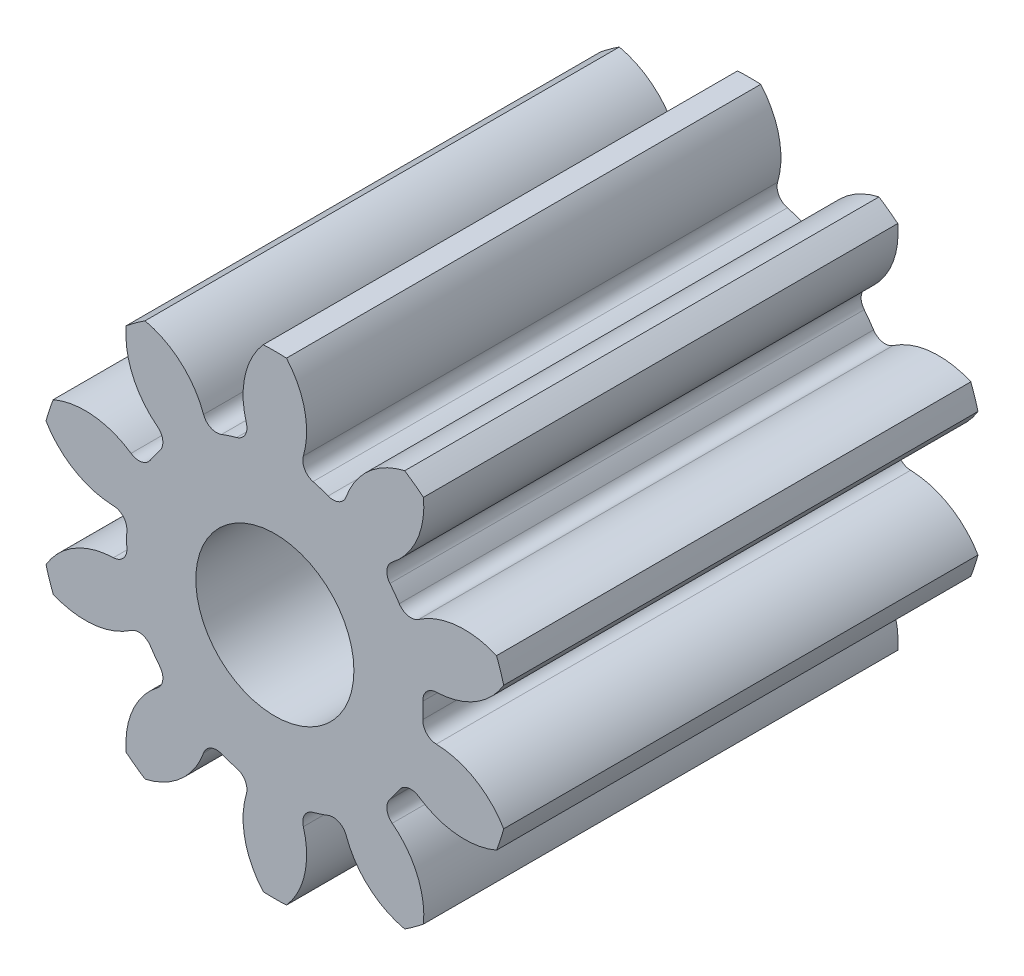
from build123d import *

# Parameters (mm, degrees)
BOSS_EXTRU_1_DEPTH                 = 6
CONG_1_R                           = 0.175
R_P_TITION_CIRCULAIRE4_COUNT       = 10
CONG_1_OF_R_P_TITION_CIRCULAIRE4_R = 0.175
ESQUISSE10_R                       = 1
ENL_V_MAT_EXTRU_4_DEPTH            = 9.181798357


with BuildPart() as part:
    # Esquisse3 → Boss.-Extru.1 (new body)
    with BuildSketch(Plane.XY):
        with BuildLine():
            Line((-1.958113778, 1.222878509), (-1.378706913, -0.560352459))
            Line((-1.378706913, -0.560352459), (-0.799300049, 1.222878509))
            ThreePointArc((-0.799300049, 1.222878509), (-0.942925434, 1.263303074), (-1.089310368, 1.292179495))
            ThreePointArc((-1.089310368, 1.292179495), (-0.984517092, 1.886051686), (-1.231837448, 2.436050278))
            ThreePointArc((-1.231837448, 2.436050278), (-1.378706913, 2.439647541), (-1.525576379, 2.436050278))
            ThreePointArc((-1.525576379, 2.436050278), (-1.772896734, 1.886051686), (-1.668103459, 1.292179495))
            ThreePointArc((-1.668103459, 1.292179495), (-1.814488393, 1.263303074), (-1.958113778, 1.222878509))
        make_face()
    boss_extru_1 = extrude(amount=BOSS_EXTRU_1_DEPTH)

    # Cong_1
    cong_1_edges = [part.edges().sort_by_distance(p)[0] for p in [
        (-1.668103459, 1.292179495, 3),
        (-1.089310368, 1.292179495, 3),
    ]]
    fillet(cong_1_edges, radius=CONG_1_R)

    # R_p_tition circulaire4: Boss.-Extru.1 ×10 about axis
    r_p_tition_circulaire4_axis = Axis((-1.378706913, -0.560352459, 0), (0, 0, 1))
    for i in range(1, R_P_TITION_CIRCULAIRE4_COUNT):
        add(boss_extru_1.rotate(r_p_tition_circulaire4_axis, i * 360 / R_P_TITION_CIRCULAIRE4_COUNT))

    # Cong_1 of R_p_tition circulaire4
    cong_1_of_r_p_tition_circulaire4_edges = [part.edges().sort_by_distance(p)[0] for p in [
        (-2.701724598, 0.768274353, 3),
        (-2.233471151, 1.108480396, 3),
        (-3.22999795, -0.263121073, 3),
        (-3.051141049, 0.287343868, 3),
        (-3.051141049, -1.408048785, 3),
        (-3.22999795, -0.857583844, 3),
        (-2.233471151, -2.229185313, 3),
        (-2.701724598, -1.88897927, 3),
        (-1.089310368, -2.412884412, 3),
        (-1.668103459, -2.412884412, 3),
        (-0.055689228, -1.88897927, 3),
        (-0.523942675, -2.229185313, 3),
        (0.472584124, -0.857583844, 3),
        (0.293727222, -1.408048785, 3),
        (0.293727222, 0.287343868, 3),
        (0.472584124, -0.263121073, 3),
        (-0.523942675, 1.108480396, 3),
        (-0.055689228, 0.768274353, 3),
    ]]
    fillet(cong_1_of_r_p_tition_circulaire4_edges, radius=CONG_1_OF_R_P_TITION_CIRCULAIRE4_R)

    # Esquisse10 → Enl_v. mat.-Extru.4 (cut, through all)
    with BuildSketch(Plane.XY):
        with Locations((-1.378706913, -0.560352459)):
            Circle(ESQUISSE10_R)
    extrude(amount=ENL_V_MAT_EXTRU_4_DEPTH, mode=Mode.SUBTRACT)


solid = part.part
